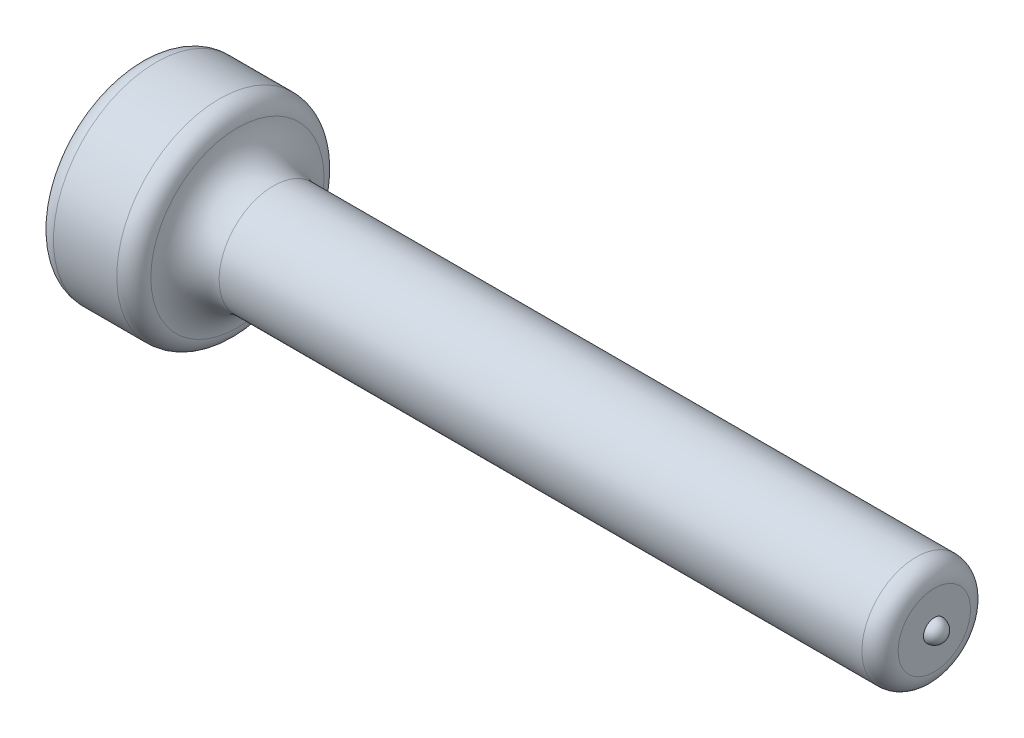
ISO-10303-21;
HEADER;
FILE_DESCRIPTION(('STEP AP214'),'2;1');
FILE_NAME('part.step','',(''),(''),'','','');
FILE_SCHEMA(('AUTOMOTIVE_DESIGN { 1 0 10303 214 1 1 1 1 }'));
ENDSEC;
DATA;
#1=APPLICATION_CONTEXT('core data for automotive mechanical design processes');
#2=APPLICATION_PROTOCOL_DEFINITION('international standard','automotive_design',2000,#1);
#3=PRODUCT_CONTEXT('',#1,'mechanical');
#4=PRODUCT('Part','Part','',(#3));
#5=PRODUCT_RELATED_PRODUCT_CATEGORY('part','',(#4));
#6=PRODUCT_DEFINITION_FORMATION('','',#4);
#7=PRODUCT_DEFINITION_CONTEXT('part definition',#1,'design');
#8=PRODUCT_DEFINITION('design','',#6,#7);
#9=PRODUCT_DEFINITION_SHAPE('','',#8);
#10=(LENGTH_UNIT() NAMED_UNIT(*) SI_UNIT(.MILLI.,.METRE.));
#11=(NAMED_UNIT(*) PLANE_ANGLE_UNIT() SI_UNIT($,.RADIAN.));
#12=(NAMED_UNIT(*) SI_UNIT($,.STERADIAN.) SOLID_ANGLE_UNIT());
#13=UNCERTAINTY_MEASURE_WITH_UNIT(LENGTH_MEASURE(1.E-05),#10,'distance_accuracy_value','');
#14=(GEOMETRIC_REPRESENTATION_CONTEXT(3) GLOBAL_UNCERTAINTY_ASSIGNED_CONTEXT((#13)) GLOBAL_UNIT_ASSIGNED_CONTEXT((#10,
#11,#12)) REPRESENTATION_CONTEXT('',''));
#15=CARTESIAN_POINT('',(0.,0.,0.));
#16=DIRECTION('',(0.,0.,1.));
#17=DIRECTION('',(1.,0.,0.));
#18=AXIS2_PLACEMENT_3D('',#15,#16,#17);
#19=CARTESIAN_POINT('',(44.,0.,0.));
#20=DIRECTION('',(-1.,0.,0.));
#21=DIRECTION('',(0.,-1.,0.));
#22=AXIS2_PLACEMENT_3D('',#19,#20,#21);
#23=PLANE('',#22);
#24=CARTESIAN_POINT('',(44.,0.,0.));
#25=DIRECTION('',(-1.,0.,0.));
#26=DIRECTION('',(0.,-1.,0.));
#27=AXIS2_PLACEMENT_3D('',#24,#25,#26);
#28=CIRCLE('',#27,2.);
#29=CARTESIAN_POINT('',(44.,-1.99999999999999,0.));
#30=VERTEX_POINT('',#29);
#31=EDGE_CURVE('E53',#30,#30,#28,.F.);
#32=ORIENTED_EDGE('',*,*,#31,.T.);
#33=EDGE_LOOP('',(#32));
#34=FACE_BOUND('',#33,.T.);
#35=CARTESIAN_POINT('',(44.,0.,0.));
#36=DIRECTION('',(-1.,0.,0.));
#37=DIRECTION('',(0.,-1.,0.));
#38=AXIS2_PLACEMENT_3D('',#35,#36,#37);
#39=CIRCLE('',#38,0.600000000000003);
#40=CARTESIAN_POINT('',(44.,-0.599999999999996,0.));
#41=VERTEX_POINT('',#40);
#42=EDGE_CURVE('E10',#41,#41,#39,.F.);
#43=ORIENTED_EDGE('',*,*,#42,.F.);
#44=EDGE_LOOP('',(#43));
#45=FACE_BOUND('',#44,.T.);
#46=ADVANCED_FACE('F30',(#34,#45),#23,.F.);
#47=CARTESIAN_POINT('',(-36.5324999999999,0.,0.));
#48=DIRECTION('',(-1.,0.,0.));
#49=DIRECTION('',(0.,-1.,0.));
#50=AXIS2_PLACEMENT_3D('',#47,#48,#49);
#51=CYLINDRICAL_SURFACE('',#50,3.);
#52=CARTESIAN_POINT('',(43.,0.,0.));
#53=DIRECTION('',(-1.,0.,0.));
#54=DIRECTION('',(0.,-1.,0.));
#55=AXIS2_PLACEMENT_3D('',#52,#53,#54);
#56=CIRCLE('',#55,3.);
#57=CARTESIAN_POINT('',(43.,-2.99999999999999,0.));
#58=VERTEX_POINT('',#57);
#59=EDGE_CURVE('E56',#58,#58,#56,.T.);
#60=ORIENTED_EDGE('',*,*,#59,.T.);
#61=EDGE_LOOP('',(#60));
#62=FACE_BOUND('',#61,.T.);
#63=CARTESIAN_POINT('',(7.48,0.,0.));
#64=DIRECTION('',(-1.,0.,0.));
#65=DIRECTION('',(0.,-1.,0.));
#66=AXIS2_PLACEMENT_3D('',#63,#64,#65);
#67=CIRCLE('',#66,3.);
#68=CARTESIAN_POINT('',(7.48,-3.,0.));
#69=VERTEX_POINT('',#68);
#70=EDGE_CURVE('E59',#69,#69,#67,.F.);
#71=ORIENTED_EDGE('',*,*,#70,.T.);
#72=EDGE_LOOP('',(#71));
#73=FACE_BOUND('',#72,.T.);
#74=ADVANCED_FACE('F81',(#62,#73),#51,.T.);
#75=CARTESIAN_POINT('',(-36.5324999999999,0.,0.));
#76=DIRECTION('',(-1.,0.,0.));
#77=DIRECTION('',(0.,-1.,0.));
#78=AXIS2_PLACEMENT_3D('',#75,#76,#77);
#79=CYLINDRICAL_SURFACE('',#78,5.675);
#80=CARTESIAN_POINT('',(4.4976561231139,0.,0.));
#81=DIRECTION('',(1.,0.,0.));
#82=DIRECTION('',(0.,1.,0.));
#83=AXIS2_PLACEMENT_3D('',#80,#81,#82);
#84=CIRCLE('',#83,5.675);
#85=CARTESIAN_POINT('',(4.4976561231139,5.675,0.));
#86=VERTEX_POINT('',#85);
#87=EDGE_CURVE('E45',#86,#86,#84,.F.);
#88=ORIENTED_EDGE('',*,*,#87,.T.);
#89=EDGE_LOOP('',(#88));
#90=FACE_BOUND('',#89,.T.);
#91=CARTESIAN_POINT('',(1.,0.,0.));
#92=DIRECTION('',(1.,0.,0.));
#93=DIRECTION('',(0.,1.,0.));
#94=AXIS2_PLACEMENT_3D('',#91,#92,#93);
#95=CIRCLE('',#94,5.675);
#96=CARTESIAN_POINT('',(1.,5.675,0.));
#97=VERTEX_POINT('',#96);
#98=EDGE_CURVE('E50',#97,#97,#95,.T.);
#99=ORIENTED_EDGE('',*,*,#98,.T.);
#100=EDGE_LOOP('',(#99));
#101=FACE_BOUND('',#100,.T.);
#102=ADVANCED_FACE('F87',(#90,#101),#79,.T.);
#103=CARTESIAN_POINT('',(0.,5.675,0.));
#104=DIRECTION('',(1.,0.,0.));
#105=DIRECTION('',(0.,1.,0.));
#106=AXIS2_PLACEMENT_3D('',#103,#104,#105);
#107=PLANE('',#106);
#108=CARTESIAN_POINT('',(0.,0.,0.));
#109=DIRECTION('',(1.,0.,0.));
#110=DIRECTION('',(0.,1.,0.));
#111=AXIS2_PLACEMENT_3D('',#108,#109,#110);
#112=CIRCLE('',#111,3.78333333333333);
#113=CARTESIAN_POINT('',(0.,3.78333333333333,0.));
#114=VERTEX_POINT('',#113);
#115=EDGE_CURVE('E62',#114,#114,#112,.T.);
#116=ORIENTED_EDGE('',*,*,#115,.T.);
#117=EDGE_LOOP('',(#116));
#118=FACE_BOUND('',#117,.T.);
#119=CARTESIAN_POINT('',(0.,0.,0.));
#120=DIRECTION('',(1.,0.,0.));
#121=DIRECTION('',(0.,1.,0.));
#122=AXIS2_PLACEMENT_3D('',#119,#120,#121);
#123=CIRCLE('',#122,4.675);
#124=CARTESIAN_POINT('',(0.,4.675,0.));
#125=VERTEX_POINT('',#124);
#126=EDGE_CURVE('E37',#125,#125,#123,.F.);
#127=ORIENTED_EDGE('',*,*,#126,.T.);
#128=EDGE_LOOP('',(#127));
#129=FACE_BOUND('',#128,.T.);
#130=ADVANCED_FACE('F97',(#118,#129),#107,.F.);
#131=CARTESIAN_POINT('',(7.48,0.,0.));
#132=DIRECTION('',(-1.,0.,0.));
#133=DIRECTION('',(0.,-1.,0.));
#134=AXIS2_PLACEMENT_3D('',#131,#132,#133);
#135=TOROIDAL_SURFACE('',#134,5.,2.);
#136=CARTESIAN_POINT('',(5.49177074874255,0.,0.));
#137=DIRECTION('',(1.,0.,0.));
#138=DIRECTION('',(0.,1.,0.));
#139=AXIS2_PLACEMENT_3D('',#136,#137,#138);
#140=CIRCLE('',#139,4.78333333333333);
#141=CARTESIAN_POINT('',(5.49177074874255,4.78333333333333,0.));
#142=VERTEX_POINT('',#141);
#143=EDGE_CURVE('E41',#142,#142,#140,.T.);
#144=ORIENTED_EDGE('',*,*,#143,.T.);
#145=EDGE_LOOP('',(#144));
#146=FACE_BOUND('',#145,.T.);
#147=ORIENTED_EDGE('',*,*,#70,.F.);
#148=EDGE_LOOP('',(#147));
#149=FACE_BOUND('',#148,.T.);
#150=ADVANCED_FACE('F93',(#146,#149),#135,.F.);
#151=CARTESIAN_POINT('',(43.,0.,0.));
#152=DIRECTION('',(-1.,0.,0.));
#153=DIRECTION('',(0.,-1.,0.));
#154=AXIS2_PLACEMENT_3D('',#151,#152,#153);
#155=TOROIDAL_SURFACE('',#154,2.,1.);
#156=ORIENTED_EDGE('',*,*,#31,.F.);
#157=EDGE_LOOP('',(#156));
#158=FACE_BOUND('',#157,.T.);
#159=ORIENTED_EDGE('',*,*,#59,.F.);
#160=EDGE_LOOP('',(#159));
#161=FACE_BOUND('',#160,.T.);
#162=ADVANCED_FACE('F96',(#158,#161),#155,.T.);
#163=CARTESIAN_POINT('',(4.4976561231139,0.,0.));
#164=DIRECTION('',(1.,0.,0.));
#165=DIRECTION('',(0.,1.,0.));
#166=AXIS2_PLACEMENT_3D('',#163,#164,#165);
#167=TOROIDAL_SURFACE('',#166,4.675,1.);
#168=ORIENTED_EDGE('',*,*,#143,.F.);
#169=EDGE_LOOP('',(#168));
#170=FACE_BOUND('',#169,.T.);
#171=ORIENTED_EDGE('',*,*,#87,.F.);
#172=EDGE_LOOP('',(#171));
#173=FACE_BOUND('',#172,.T.);
#174=ADVANCED_FACE('F100',(#170,#173),#167,.T.);
#175=CARTESIAN_POINT('',(1.,0.,0.));
#176=DIRECTION('',(1.,0.,0.));
#177=DIRECTION('',(0.,1.,0.));
#178=AXIS2_PLACEMENT_3D('',#175,#176,#177);
#179=TOROIDAL_SURFACE('',#178,4.675,1.);
#180=ORIENTED_EDGE('',*,*,#98,.F.);
#181=EDGE_LOOP('',(#180));
#182=FACE_BOUND('',#181,.T.);
#183=ORIENTED_EDGE('',*,*,#126,.F.);
#184=EDGE_LOOP('',(#183));
#185=FACE_BOUND('',#184,.T.);
#186=ADVANCED_FACE('F32',(#182,#185),#179,.T.);
#187=CARTESIAN_POINT('',(44.,0.,0.));
#188=DIRECTION('',(-1.,0.,0.));
#189=DIRECTION('',(0.,-1.,0.));
#190=AXIS2_PLACEMENT_3D('',#187,#188,#189);
#191=SPHERICAL_SURFACE('',#190,0.600000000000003);
#192=ORIENTED_EDGE('',*,*,#42,.T.);
#193=EDGE_LOOP('',(#192));
#194=FACE_BOUND('',#193,.T.);
#195=ADVANCED_FACE('F77',(#194),#191,.T.);
#196=CARTESIAN_POINT('',(0.,0.,0.));
#197=DIRECTION('',(1.,0.,0.));
#198=DIRECTION('',(0.,1.,0.));
#199=AXIS2_PLACEMENT_3D('',#196,#197,#198);
#200=CYLINDRICAL_SURFACE('',#199,3.78333333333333);
#201=ORIENTED_EDGE('',*,*,#115,.F.);
#202=EDGE_LOOP('',(#201));
#203=FACE_BOUND('',#202,.T.);
#204=CARTESIAN_POINT('',(1.096,0.,0.));
#205=DIRECTION('',(1.,0.,0.));
#206=DIRECTION('',(0.,1.,0.));
#207=AXIS2_PLACEMENT_3D('',#204,#205,#206);
#208=CIRCLE('',#207,3.78333333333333);
#209=CARTESIAN_POINT('',(1.096,3.78333333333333,0.));
#210=VERTEX_POINT('',#209);
#211=EDGE_CURVE('E65',#210,#210,#208,.T.);
#212=ORIENTED_EDGE('',*,*,#211,.T.);
#213=EDGE_LOOP('',(#212));
#214=FACE_BOUND('',#213,.T.);
#215=ADVANCED_FACE('F69',(#203,#214),#200,.F.);
#216=CARTESIAN_POINT('',(1.096,0.,0.));
#217=DIRECTION('',(1.,0.,0.));
#218=DIRECTION('',(0.,1.,0.));
#219=AXIS2_PLACEMENT_3D('',#216,#217,#218);
#220=PLANE('',#219);
#221=ORIENTED_EDGE('',*,*,#211,.F.);
#222=EDGE_LOOP('',(#221));
#223=FACE_BOUND('',#222,.T.);
#224=ADVANCED_FACE('F71',(#223),#220,.F.);
#225=CLOSED_SHELL('',(#46,#74,#102,#130,#150,#162,#174,#186,#195,#215,#224));
#226=MANIFOLD_SOLID_BREP('B2',#225);
#227=ADVANCED_BREP_SHAPE_REPRESENTATION('',(#18,#226),#14);
#228=SHAPE_DEFINITION_REPRESENTATION(#9,#227);
ENDSEC;
END-ISO-10303-21;
